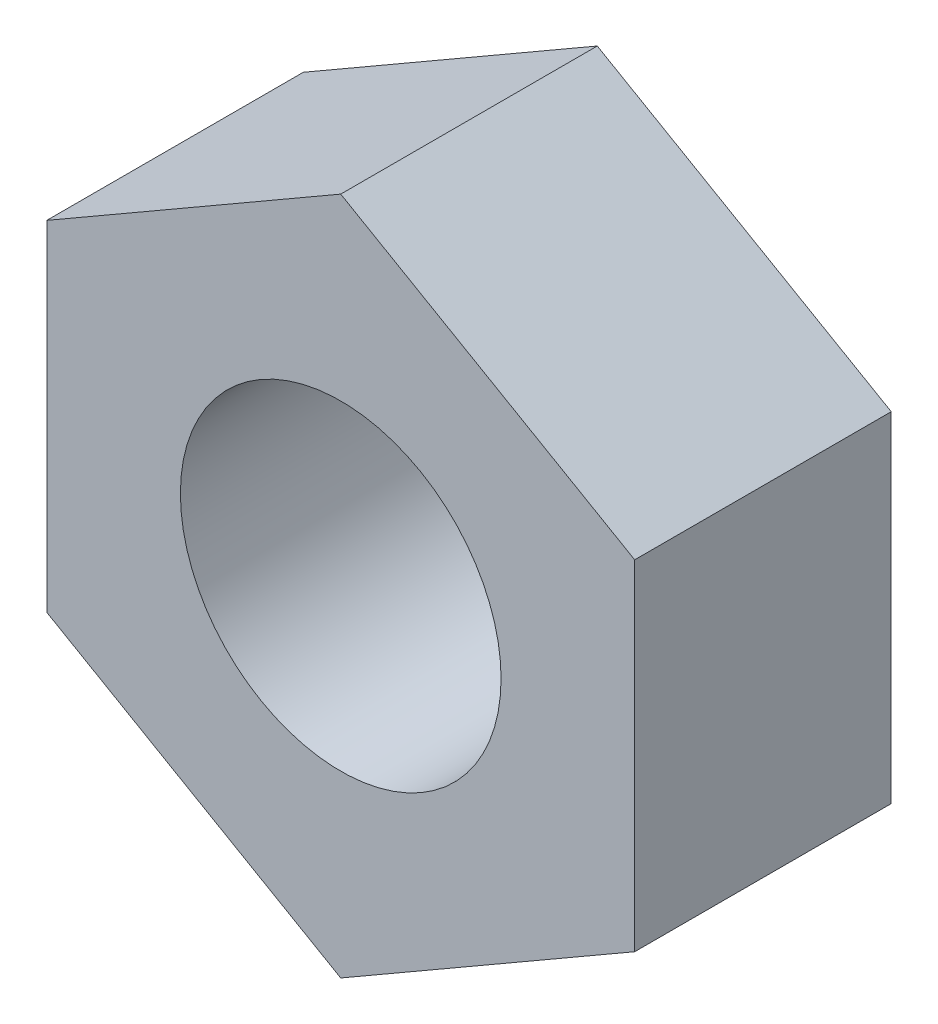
from build123d import *

# Parameters (mm, degrees)
SKETCH_1_R                   = 1.5
UNTHREADED_NOMINAL_NUT_DEPTH = 2.4


with BuildPart() as part:
    # Sketch 1 → Unthreaded_nominal_nut (new body)
    with BuildSketch(Plane.XY):
        Polygon((2.75, 1.58771324), (0, 3.175426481), (-2.75, 1.58771324), (-2.75, -1.58771324), (0, -3.175426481), (2.75, -1.58771324), align=None)
        Circle(SKETCH_1_R, mode=Mode.SUBTRACT)
    extrude(amount=UNTHREADED_NOMINAL_NUT_DEPTH)


solid = part.part
